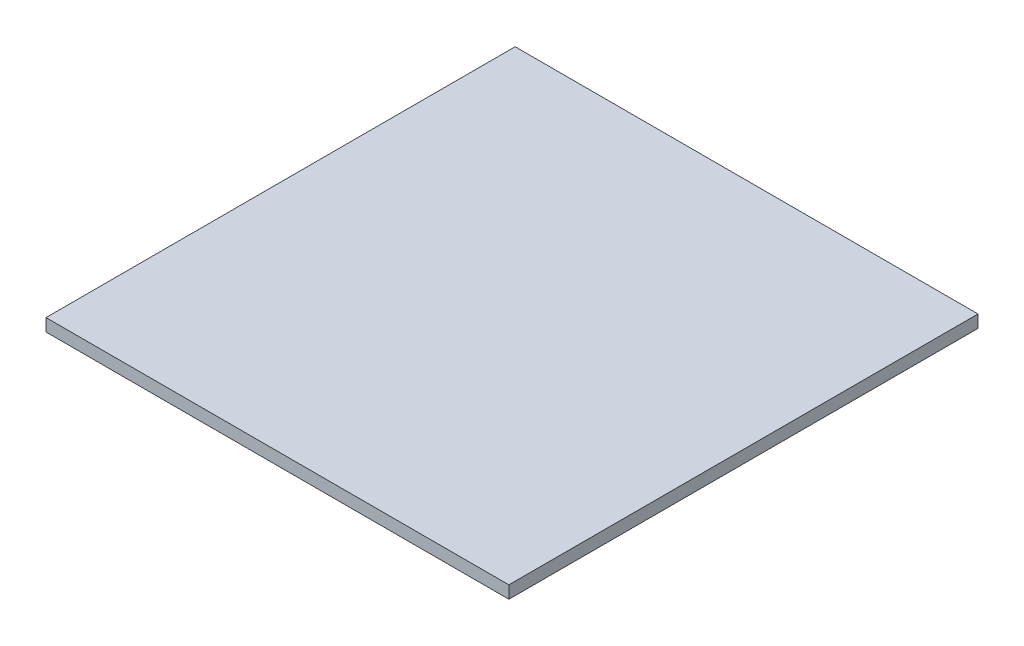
from build123d import *

# Parameters (mm, degrees)
ESQUISSE1_W      = 74
ESQUISSE1_H      = 75
EXTRUSION1_DEPTH = 2


with BuildPart() as part:
    # Esquisse1 → Extrusion1 (new body)
    with BuildSketch(Plane(origin=(0, 0, 0), x_dir=(1, 0, 0), z_dir=(0, 1, 0))):
        with Locations((37, 37.5)):
            Rectangle(ESQUISSE1_W, ESQUISSE1_H)
    extrude(amount=EXTRUSION1_DEPTH)


solid = part.part
